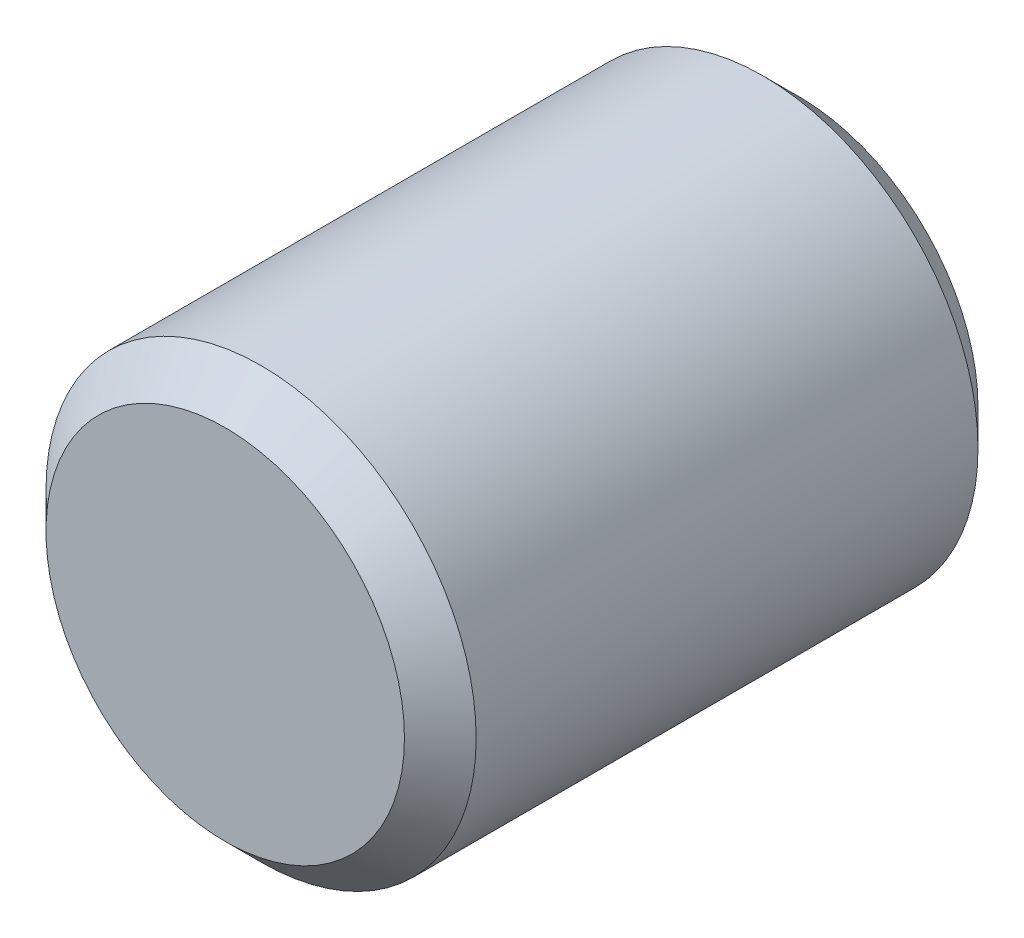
ISO-10303-21;
HEADER;
FILE_DESCRIPTION(('STEP AP214'),'2;1');
FILE_NAME('part.step','',(''),(''),'','','');
FILE_SCHEMA(('AUTOMOTIVE_DESIGN { 1 0 10303 214 1 1 1 1 }'));
ENDSEC;
DATA;
#1=APPLICATION_CONTEXT('core data for automotive mechanical design processes');
#2=APPLICATION_PROTOCOL_DEFINITION('international standard','automotive_design',2000,#1);
#3=PRODUCT_CONTEXT('',#1,'mechanical');
#4=PRODUCT('Part','Part','',(#3));
#5=PRODUCT_RELATED_PRODUCT_CATEGORY('part','',(#4));
#6=PRODUCT_DEFINITION_FORMATION('','',#4);
#7=PRODUCT_DEFINITION_CONTEXT('part definition',#1,'design');
#8=PRODUCT_DEFINITION('design','',#6,#7);
#9=PRODUCT_DEFINITION_SHAPE('','',#8);
#10=(LENGTH_UNIT() NAMED_UNIT(*) SI_UNIT(.MILLI.,.METRE.));
#11=(NAMED_UNIT(*) PLANE_ANGLE_UNIT() SI_UNIT($,.RADIAN.));
#12=(NAMED_UNIT(*) SI_UNIT($,.STERADIAN.) SOLID_ANGLE_UNIT());
#13=UNCERTAINTY_MEASURE_WITH_UNIT(LENGTH_MEASURE(1.E-05),#10,'distance_accuracy_value','');
#14=(GEOMETRIC_REPRESENTATION_CONTEXT(3) GLOBAL_UNCERTAINTY_ASSIGNED_CONTEXT((#13)) GLOBAL_UNIT_ASSIGNED_CONTEXT((#10,
#11,#12)) REPRESENTATION_CONTEXT('',''));
#15=CARTESIAN_POINT('',(0.,0.,0.));
#16=DIRECTION('',(0.,0.,1.));
#17=DIRECTION('',(1.,0.,0.));
#18=AXIS2_PLACEMENT_3D('',#15,#16,#17);
#19=CARTESIAN_POINT('',(-1.66533453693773E-13,1.11022302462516E-13,16.0000000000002));
#20=DIRECTION('',(0.,0.,-1.));
#21=DIRECTION('',(-1.,0.,0.));
#22=AXIS2_PLACEMENT_3D('',#19,#20,#21);
#23=CYLINDRICAL_SURFACE('',#22,6.);
#24=CARTESIAN_POINT('',(1.38777878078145E-13,0.,14.9999999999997));
#25=DIRECTION('',(0.,0.,1.));
#26=DIRECTION('',(1.,0.,0.));
#27=AXIS2_PLACEMENT_3D('',#24,#25,#26);
#28=CIRCLE('',#27,6.);
#29=CARTESIAN_POINT('',(6.00000000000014,0.,14.9999999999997));
#30=VERTEX_POINT('',#29);
#31=EDGE_CURVE('E36',#30,#30,#28,.F.);
#32=ORIENTED_EDGE('',*,*,#31,.T.);
#33=EDGE_LOOP('',(#32));
#34=FACE_BOUND('',#33,.T.);
#35=CARTESIAN_POINT('',(0.,1.11022302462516E-13,1.00000000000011));
#36=DIRECTION('',(0.,0.,1.));
#37=DIRECTION('',(1.,0.,0.));
#38=AXIS2_PLACEMENT_3D('',#35,#36,#37);
#39=CIRCLE('',#38,6.);
#40=CARTESIAN_POINT('',(6.00000000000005,1.0769163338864E-13,1.00000000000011));
#41=VERTEX_POINT('',#40);
#42=EDGE_CURVE('E40',#41,#41,#39,.T.);
#43=ORIENTED_EDGE('',*,*,#42,.T.);
#44=EDGE_LOOP('',(#43));
#45=FACE_BOUND('',#44,.T.);
#46=ADVANCED_FACE('F30',(#34,#45),#23,.T.);
#47=CARTESIAN_POINT('',(-1.66533453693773E-13,1.11022302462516E-13,16.0000000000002));
#48=DIRECTION('',(0.,0.,1.));
#49=DIRECTION('',(1.,0.,0.));
#50=AXIS2_PLACEMENT_3D('',#47,#48,#49);
#51=PLANE('',#50);
#52=CARTESIAN_POINT('',(-1.66533453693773E-13,1.11022302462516E-13,16.0000000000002));
#53=DIRECTION('',(0.,0.,1.));
#54=DIRECTION('',(1.,0.,0.));
#55=AXIS2_PLACEMENT_3D('',#52,#53,#54);
#56=CIRCLE('',#55,4.99999999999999);
#57=CARTESIAN_POINT('',(4.99999999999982,1.08246744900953E-13,16.0000000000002));
#58=VERTEX_POINT('',#57);
#59=EDGE_CURVE('E44',#58,#58,#56,.T.);
#60=ORIENTED_EDGE('',*,*,#59,.T.);
#61=EDGE_LOOP('',(#60));
#62=FACE_BOUND('',#61,.T.);
#63=ADVANCED_FACE('F50',(#62),#51,.T.);
#64=CARTESIAN_POINT('',(0.,-1.11022302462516E-13,0.));
#65=DIRECTION('',(0.,0.,1.));
#66=DIRECTION('',(1.,0.,0.));
#67=AXIS2_PLACEMENT_3D('',#64,#65,#66);
#68=PLANE('',#67);
#69=CARTESIAN_POINT('',(0.,-1.11022302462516E-13,0.));
#70=DIRECTION('',(0.,0.,1.));
#71=DIRECTION('',(1.,0.,0.));
#72=AXIS2_PLACEMENT_3D('',#69,#70,#71);
#73=CIRCLE('',#72,4.99999999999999);
#74=CARTESIAN_POINT('',(4.99999999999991,-1.13797860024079E-13,0.));
#75=VERTEX_POINT('',#74);
#76=EDGE_CURVE('E10',#75,#75,#73,.F.);
#77=ORIENTED_EDGE('',*,*,#76,.T.);
#78=EDGE_LOOP('',(#77));
#79=FACE_BOUND('',#78,.T.);
#80=ADVANCED_FACE('F55',(#79),#68,.F.);
#81=CARTESIAN_POINT('',(-1.66533453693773E-13,1.11022302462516E-13,16.0000000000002));
#82=DIRECTION('',(0.,0.,-1.));
#83=DIRECTION('',(-1.,0.,0.));
#84=AXIS2_PLACEMENT_3D('',#81,#82,#83);
#85=CONICAL_SURFACE('',#84,4.99999999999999,0.785398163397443);
#86=ORIENTED_EDGE('',*,*,#31,.F.);
#87=EDGE_LOOP('',(#86));
#88=FACE_BOUND('',#87,.T.);
#89=ORIENTED_EDGE('',*,*,#59,.F.);
#90=EDGE_LOOP('',(#89));
#91=FACE_BOUND('',#90,.T.);
#92=ADVANCED_FACE('F52',(#88,#91),#85,.T.);
#93=CARTESIAN_POINT('',(0.,1.11022302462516E-13,1.00000000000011));
#94=DIRECTION('',(0.,0.,1.));
#95=DIRECTION('',(1.,0.,0.));
#96=AXIS2_PLACEMENT_3D('',#93,#94,#95);
#97=CONICAL_SURFACE('',#96,6.,0.785398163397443);
#98=ORIENTED_EDGE('',*,*,#76,.F.);
#99=EDGE_LOOP('',(#98));
#100=FACE_BOUND('',#99,.T.);
#101=ORIENTED_EDGE('',*,*,#42,.F.);
#102=EDGE_LOOP('',(#101));
#103=FACE_BOUND('',#102,.T.);
#104=ADVANCED_FACE('F54',(#100,#103),#97,.T.);
#105=CLOSED_SHELL('',(#46,#63,#80,#92,#104));
#106=MANIFOLD_SOLID_BREP('B2',#105);
#107=ADVANCED_BREP_SHAPE_REPRESENTATION('',(#18,#106),#14);
#108=SHAPE_DEFINITION_REPRESENTATION(#9,#107);
ENDSEC;
END-ISO-10303-21;
